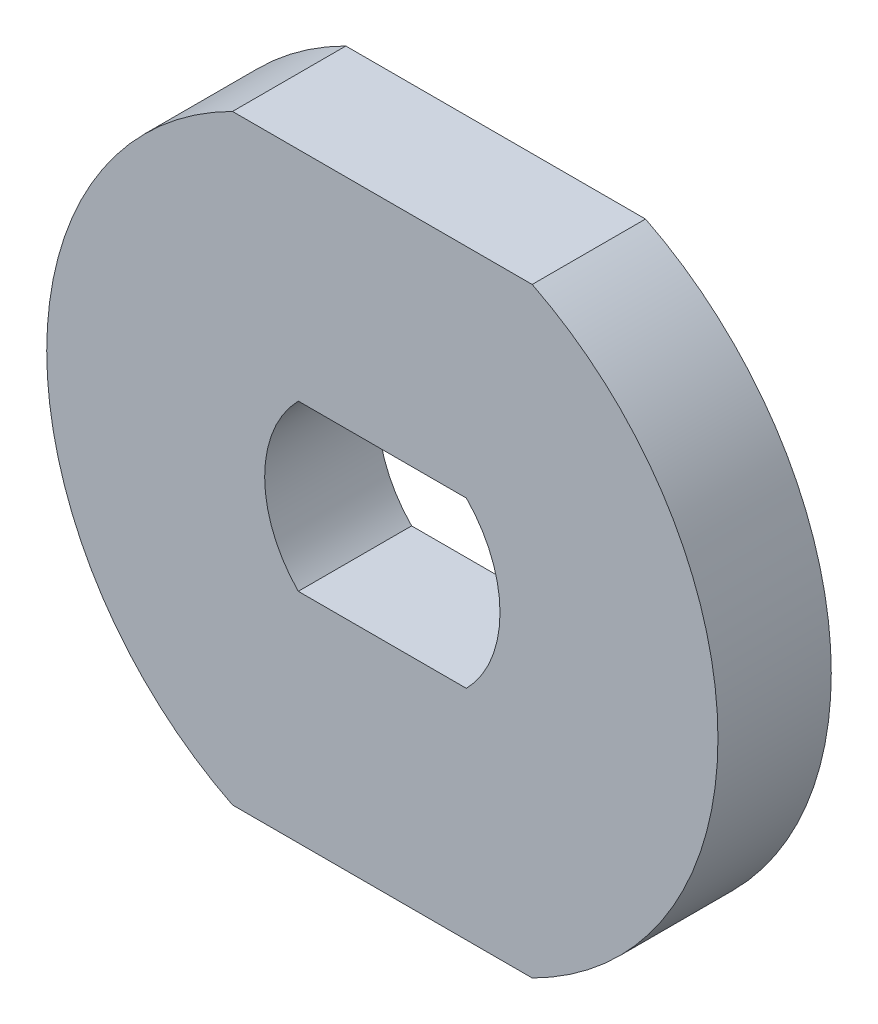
from build123d import *

# Parameters (mm, degrees)
SALIENTE_EXTRUIR1_DEPTH = 2.6


with BuildPart() as part:
    # Croquis1 → Saliente-Extruir1 (new body)
    with BuildSketch(Plane.XY):
        with BuildLine():
            Line((-14.937717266, 23.479444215), (-8.062282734, 23.479444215))
            ThreePointArc((-8.062282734, 23.479444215), (-3.8, 16.589444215), (-8.062282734, 9.699444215))
            Line((-8.062282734, 9.699444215), (-14.937717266, 9.699444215))
            ThreePointArc((-14.937717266, 9.699444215), (-19.2, 16.589444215), (-14.937717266, 23.479444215))
        make_face()
        with BuildLine():
            Line((-13.428185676, 14.699444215), (-9.571814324, 14.699444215))
            ThreePointArc((-9.571814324, 14.699444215), (-8.8, 16.589444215), (-9.571814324, 18.479444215))
            Line((-9.571814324, 18.479444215), (-13.428185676, 18.479444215))
            ThreePointArc((-13.428185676, 18.479444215), (-14.2, 16.589444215), (-13.428185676, 14.699444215))
        make_face(mode=Mode.SUBTRACT)
    extrude(amount=SALIENTE_EXTRUIR1_DEPTH)


solid = part.part
